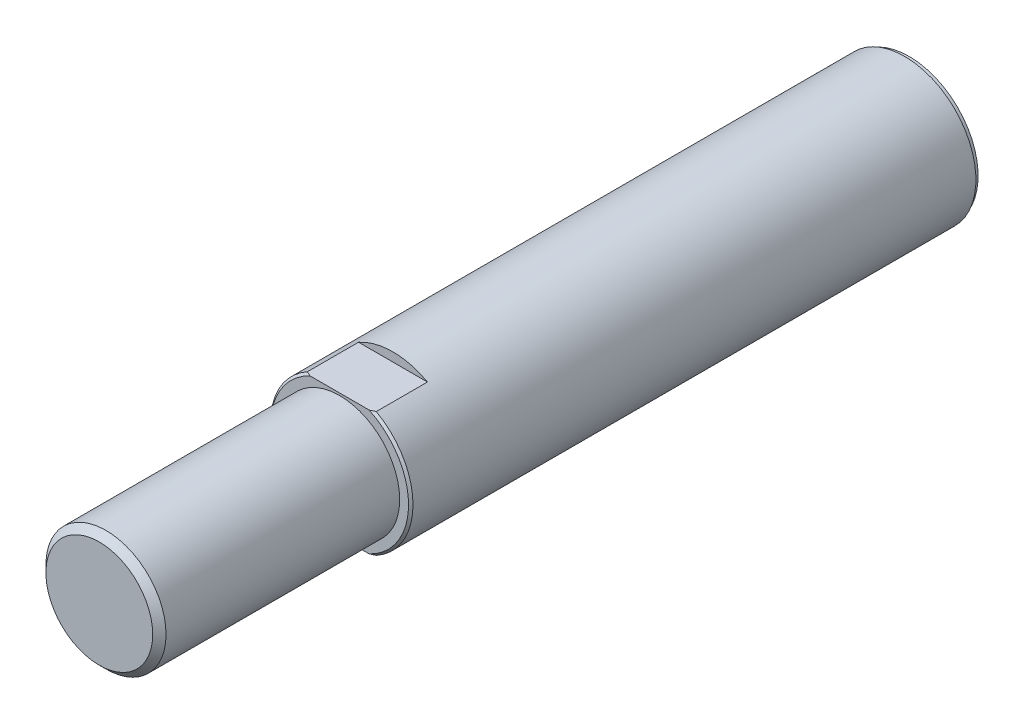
from build123d import *

# Parameters (mm, degrees)
ESBO_O1_R                      = 16
RESSALTO_EXTRUS_O1_DEPTH       = 182
ESBO_O2_OUTSIDE_W              = 71.508
ESBO_O2_OUTSIDE_H              = 71.508
ESBO_O2_OUTSIDE_R              = 13.5
CORTE_EXTRUS_O1_DEPTH          = 54
FURO_ROSCADO_DE_M14X2_01_D     = 12
FURO_ROSCADO_DE_M14X2_01_DEPTH = 50
FURO_ROSCADO_DE_M14X2_01_TIP   = 3.605163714
ESBO_O5_OUTSIDE_W              = 71.508
ESBO_O5_OUTSIDE_H              = 71.508
ESBO_O5_OUTSIDE_R              = 15.5
CORTE_EXTRUS_O2_DEPTH          = 1
CHANFRO1_SIZE                  = 1.5
CHANFRO2_SIZE                  = 0.5
ESBO_O6_OUTSIDE_W              = 71.508
ESBO_O6_OUTSIDE_H              = 71.508
ESBO_O6_OUTSIDE_W_2            = 48.742790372
ESBO_O6_OUTSIDE_H_2            = 28
CORTE_EXTRUS_O3_DEPTH          = 12


with BuildPart() as part:
    # Esbo_o1 → Ressalto-extrus_o1 (new body)
    with BuildSketch(Plane.XY):
        Circle(ESBO_O1_R)
    extrude(amount=RESSALTO_EXTRUS_O1_DEPTH)

    # Esbo_o2 outside → Corte-extrus_o1 (cut)
    with BuildSketch(Plane.XY.offset(182)):
        Rectangle(ESBO_O2_OUTSIDE_W, ESBO_O2_OUTSIDE_H)
        Circle(ESBO_O2_OUTSIDE_R, mode=Mode.SUBTRACT)
    extrude(amount=-CORTE_EXTRUS_O1_DEPTH, mode=Mode.SUBTRACT)

    # Furo roscado de M14x2.01
    with Locations(Plane(origin=(0, 0, 0), x_dir=(-1, 0, 0), z_dir=(0, 0, -1))):
        with Locations((0, 0)):
            Hole(FURO_ROSCADO_DE_M14X2_01_D / 2, depth=FURO_ROSCADO_DE_M14X2_01_DEPTH)
            with Locations((0, 0, -(FURO_ROSCADO_DE_M14X2_01_DEPTH + FURO_ROSCADO_DE_M14X2_01_TIP / 2))):  # 118° drill point
                Cone(0, FURO_ROSCADO_DE_M14X2_01_D / 2, FURO_ROSCADO_DE_M14X2_01_TIP, mode=Mode.SUBTRACT)

    # Esbo_o5 outside → Corte-extrus_o2 (cut)
    with BuildSketch(Plane(origin=(0, 0, 0), x_dir=(-1, 0, 0), z_dir=(0, 0, -1))):
        Rectangle(ESBO_O5_OUTSIDE_W, ESBO_O5_OUTSIDE_H)
        Circle(ESBO_O5_OUTSIDE_R, mode=Mode.SUBTRACT)
    extrude(amount=-CORTE_EXTRUS_O2_DEPTH, mode=Mode.SUBTRACT)

    # Chanfro1
    chanfro1_edges = [part.edges().sort_by_distance(p)[0] for p in [
        (-13.5, 0, 182),
    ]]
    chamfer(chanfro1_edges, length=CHANFRO1_SIZE)

    # Chanfro2
    chanfro2_edges = [part.edges().sort_by_distance(p)[0] for p in [
        (-16, 0, 128),
    ]]
    chamfer(chanfro2_edges, length=CHANFRO2_SIZE)

    # Esbo_o6 outside → Corte-extrus_o3 (cut)
    with BuildSketch(Plane.XY.offset(128)):
        Rectangle(ESBO_O6_OUTSIDE_W, ESBO_O6_OUTSIDE_H)
        Rectangle(ESBO_O6_OUTSIDE_W_2, ESBO_O6_OUTSIDE_H_2, mode=Mode.SUBTRACT)
    extrude(amount=-CORTE_EXTRUS_O3_DEPTH, mode=Mode.SUBTRACT)


solid = part.part
